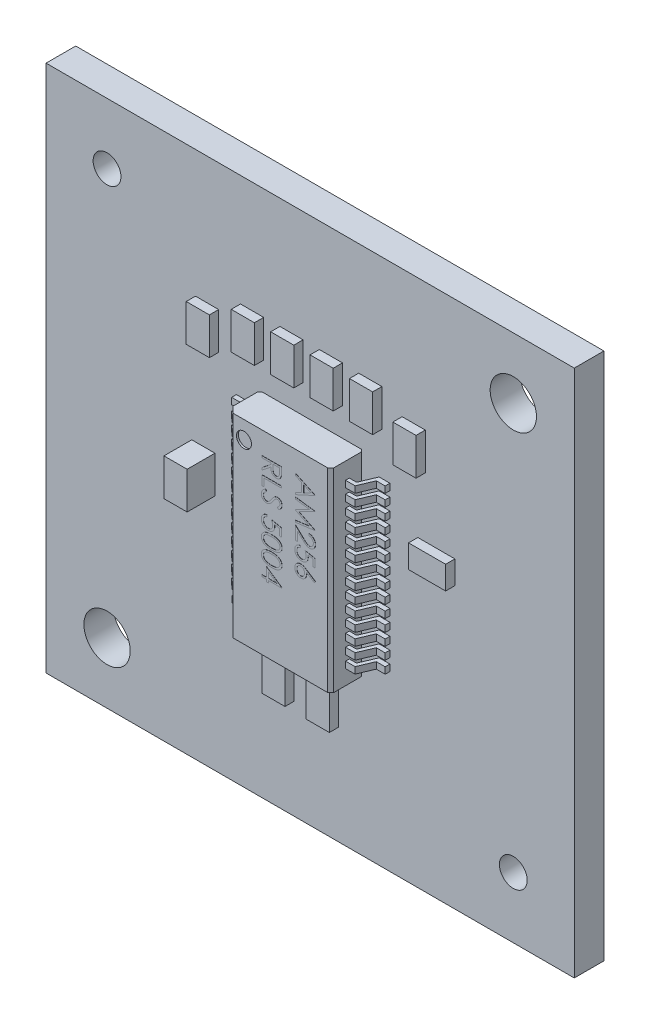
from build123d import *

# Parameters (mm, degrees)
SKETCH1_R           = 0.005
BASE_EXTRUDE_DEPTH  = 1.86
SKETCH5_R           = 0.404245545
CUT_EXTRUDE5_DEPTH  = 0.1
CUT_EXTRUDE9_DEPTH  = 11
BOSS_EXTRUDE1_DEPTH = 0.01
SKETCH7_W           = 28.5
SKETCH7_H           = 28.5
SKETCH7_R           = 1.25
SKETCH7_R_2         = 0.75
EXTRUDE1_DEPTH      = 1.6
SKETCH14_W          = 3.5
SKETCH14_H          = 1.6
SKETCH14_W_2        = 1.2
SKETCH14_H_2        = 1.2
BOSS_EXTRUDE2_DEPTH = 0.05
SKETCH12_W          = 1.25
SKETCH12_H          = 2
SKETCH12_W_2        = 2
SKETCH12_H_2        = 1.25
EXTRUDE6_DEPTH      = 0.5
SKETCH18_W          = 1.25
SKETCH18_H          = 2
BOSS_EXTRUDE4_DEPTH = 1


with BuildPart() as part:
    # Sketch1 → Base-Extrude (new body)
    with BuildSketch(Plane.XY):
        Polygon((7.968512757, 8.897793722), (9.301851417, 8.897793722), (9.301851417, 8.547793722), (7.968512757, 8.547793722), (7.968512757, 8.247793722), (9.301851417, 8.247793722), (9.301851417, 7.897793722), (7.968512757, 7.897793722), (7.968512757, 7.597793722), (9.301851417, 7.597793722), (9.301851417, 7.247793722), (7.968512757, 7.247793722), (7.968512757, 6.947793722), (9.301851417, 6.947793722), (9.301851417, 6.597793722), (7.968512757, 6.597793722), (7.968512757, 6.297793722), (9.301851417, 6.297793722), (9.301851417, 5.947793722), (7.968512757, 5.947793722), (7.968512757, 5.647793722), (9.301851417, 5.647793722), (9.301851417, 5.297793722), (7.968512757, 5.297793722), (7.968512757, 4.997793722), (9.301851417, 4.997793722), (9.301851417, 4.647793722), (7.968512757, 4.647793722), (7.968512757, 4.347793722), (9.301851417, 4.347793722), (9.301851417, 3.997793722), (7.968512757, 3.997793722), (7.968512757, 3.697793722), (9.301851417, 3.697793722), (9.301851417, 3.347793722), (7.968512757, 3.347793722), (7.968512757, 3.047793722), (9.301851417, 3.047793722), (9.301851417, 2.697793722), (7.968512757, 2.697793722), (7.968512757, 2.397793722), (9.301851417, 2.397793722), (9.301851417, 2.047793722), (7.968512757, 2.047793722), (7.968512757, 1.747793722), (9.301851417, 1.747793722), (9.301851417, 1.397793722), (7.968512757, 1.397793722), (7.968512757, 1.097793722), (9.301851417, 1.097793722), (9.301851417, 0.747793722), (7.968512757, 0.747793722), (7.968512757, 0.447793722), (9.301851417, 0.447793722), (9.301851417, 0.097793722), (7.968512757, 0.097793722), (7.968512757, -0.702206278), (2.368512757, -0.702206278), (2.368512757, 0.097793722), (1.018512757, 0.097793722), (1.018512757, 0.447793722), (2.368512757, 0.447793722), (2.368512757, 0.747793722), (1.018512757, 0.747793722), (1.018512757, 1.097793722), (2.368512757, 1.097793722), (2.368512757, 1.397793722), (1.018512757, 1.397793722), (1.018512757, 1.747793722), (2.368512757, 1.747793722), (2.368512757, 2.047793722), (1.018512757, 2.047793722), (1.018512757, 2.397793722), (2.368512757, 2.397793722), (2.368512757, 2.697793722), (1.018512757, 2.697793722), (1.018512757, 3.047793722), (2.368512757, 3.047793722), (2.368512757, 3.347793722), (1.018512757, 3.347793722), (1.018512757, 3.697793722), (2.368512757, 3.697793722), (2.368512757, 3.997793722), (1.018512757, 3.997793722), (1.018512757, 4.347793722), (2.368512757, 4.347793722), (2.368512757, 4.647793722), (1.018512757, 4.647793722), (1.018512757, 4.997793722), (2.368512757, 4.997793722), (2.368512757, 5.297793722), (1.018512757, 5.297793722), (1.018512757, 5.647793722), (2.368512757, 5.647793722), (2.368512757, 5.947793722), (1.018512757, 5.947793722), (1.018512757, 6.297793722), (2.368512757, 6.297793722), (2.368512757, 6.597793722), (1.018512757, 6.597793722), (1.018512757, 6.947793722), (2.368512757, 6.947793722), (2.368512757, 7.247793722), (1.018512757, 7.247793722), (1.018512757, 7.597793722), (2.368512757, 7.597793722), (2.368512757, 7.897793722), (1.018512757, 7.897793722), (1.018512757, 8.247793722), (2.368512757, 8.247793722), (2.368512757, 8.547793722), (1.018512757, 8.547793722), (1.018512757, 8.897793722), (2.368512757, 8.897793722), (2.368512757, 9.797793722), (7.968512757, 9.797793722), align=None)
        with Locations((5.168512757, 4.547793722)):
            Circle(SKETCH1_R, mode=Mode.SUBTRACT)
    extrude(amount=BASE_EXTRUDE_DEPTH)

    # Sketch5 → Cut-Extrude5 (cut)
    with BuildSketch(Plane.XY.offset(1.86)):
        with Locations((3.288537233, 8.84582504)):
            Circle(SKETCH5_R)
    extrude(amount=-CUT_EXTRUDE5_DEPTH, mode=Mode.SUBTRACT)

    # Sketch15 → Cut-Extrude9 (cut)
    with BuildSketch(Plane(origin=(0, 9.797793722, 0), x_dir=(1, 0, 0), z_dir=(0, 1, 0))):
        Polygon((1.018512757, -0.2554117), (1.515038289, -0.2554117), (1.85430492, -1.060183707), (2.368512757, -1.060183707), (2.368512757, -1.533579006), (2.706416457, -1.86), (2.651187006, -2.385690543), (0.552467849, -2.385690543), (0.552467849, -0.2554117), align=None)
        Polygon((1.617607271, 0), (1.978441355, -0.855932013), (2.368512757, -0.855932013), (2.368512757, -0.187465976), (2.485498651, -0.081833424), (7.851526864, -0.081833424), (7.968512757, -0.187465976), (7.968512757, -0.855932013), (8.35858416, -0.855932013), (8.719418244, 0), align=None)
        Polygon((9.784557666, -2.385690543), (7.747123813, -2.38958058), (7.802761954, -1.86), (7.968512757, -1.696789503), (7.968512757, -1.060183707), (8.482720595, -1.060183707), (8.821987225, -0.2554117), (9.784557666, -0.2554117), align=None)
    extrude(amount=-CUT_EXTRUDE9_DEPTH, mode=Mode.SUBTRACT)

    # Sketch6 → Boss-Extrude1 (add)
    # profile 1 of 12: a face of its own
    with BuildSketch(Plane.XY.offset(1.86)):
        Polygon((7.124163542, 8.168306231), (6.065830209, 7.679844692), (6.065830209, 7.783091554), (6.40503961, 7.939551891), (6.40503961, 8.419321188), (6.065830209, 8.580233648), (6.065830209, 8.683904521), (7.124163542, 8.181874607), align=None)
        Polygon((6.917881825, 8.176150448), (6.513586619, 8.36780376), (6.513586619, 7.989585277), align=None, mode=Mode.SUBTRACT)
    # profile 2 of 12: a face of its own
    with BuildSketch(Plane.XY.offset(1.86)):
        Polygon((6.065830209, 7.571297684), (7.124163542, 7.431585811), (7.124163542, 7.418017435), (6.255787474, 6.981073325), (7.124163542, 6.545189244), (7.124163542, 6.531408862), (6.065830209, 6.390848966), (6.065830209, 6.48625161), (6.827355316, 6.587590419), (6.065830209, 6.969625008), (6.065830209, 6.991037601), (6.829051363, 7.374556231), (6.065830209, 7.475683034), align=None)
    # profile 3 of 12: a face of its own
    with BuildSketch(Plane.XY.offset(1.86)):
        with BuildLine():
            Line((6.798522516, 6.133049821), (6.798522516, 6.228028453))
            add(Edge.make_bspline(
                [(6.798522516, 6.228028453), (6.811123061, 6.227409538), (6.835870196, 6.226194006), (6.871950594, 6.220499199), (6.906441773, 6.212358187), (6.939048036, 6.200820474), (6.970158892, 6.186572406), (6.999361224, 6.169128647), (7.026944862, 6.148861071), (7.052387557, 6.125806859), (7.075645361, 6.100790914), (7.095942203, 6.073963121), (7.112894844, 6.045599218), (7.12714393, 6.015945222), (7.137826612, 5.984658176), (7.145756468, 5.952037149), (7.150526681, 5.917934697), (7.151039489, 5.894699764), (7.151300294, 5.882882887)],
                knots=[0, 0, 0, 0, 1.100776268, 2.161895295, 3.184016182, 4.190939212, 5.176500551, 6.166955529, 7.155448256, 8.160289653, 9.16017456, 10.133824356, 11.091467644, 12.04088621, 13.000931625, 13.972173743, 14.968683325, 16, 16, 16, 16], degree=3))
            add(Edge.make_bspline(
                [(7.151300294, 5.882882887), (7.151028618, 5.871278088), (7.150494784, 5.848475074), (7.145910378, 5.815194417), (7.138730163, 5.783511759), (7.128656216, 5.753489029), (7.115114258, 5.725365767), (7.098846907, 5.698930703), (7.080032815, 5.673869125), (7.057882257, 5.651309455), (7.034235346, 5.630593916), (7.008990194, 5.61272252), (6.9829161, 5.597418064), (6.95581424, 5.584661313), (6.927429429, 5.575270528), (6.898174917, 5.568140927), (6.867747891, 5.564110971), (6.847153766, 5.563492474), (6.836683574, 5.563178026)],
                knots=[0, 0, 0, 0, 1.111607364, 2.184268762, 3.212621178, 4.221274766, 5.211760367, 6.196651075, 7.1921475, 8.207485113, 9.220403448, 10.201281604, 11.166441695, 12.114753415, 13.065576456, 14.026450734, 14.996634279, 16, 16, 16, 16], degree=3))
            add(Edge.make_bspline(
                [(6.836683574, 5.563178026), (6.821943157, 5.563690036), (6.792720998, 5.564705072), (6.749778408, 5.573387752), (6.708172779, 5.586948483), (6.674687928, 5.603276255), (6.647705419, 5.619747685), (6.625489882, 5.634590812), (6.601569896, 5.651967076), (6.576025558, 5.672129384), (6.548656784, 5.694660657), (6.519480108, 5.719764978), (6.488796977, 5.747621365), (6.467840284, 5.767172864), (6.45698105, 5.777303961)],
                knots=[0, 0, 0, 0, 1.184426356, 2.348067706, 3.509069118, 4.696110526, 5.333549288, 6.050745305, 6.844228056, 7.710549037, 8.667450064, 9.695053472, 10.805634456, 12, 12, 12, 12], degree=3))
            Line((6.45698105, 5.777303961), (6.174377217, 6.0420993))
            Line((6.174377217, 6.0420993), (6.174377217, 5.54960965))
            Line((6.174377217, 5.54960965), (6.065830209, 5.54960965))
            Line((6.065830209, 5.54960965), (6.065830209, 6.268733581))
            Line((6.065830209, 6.268733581), (6.503834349, 5.858290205))
            add(Edge.make_bspline(
                [(6.503834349, 5.858290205), (6.514265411, 5.848296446), (6.534301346, 5.82910048), (6.563562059, 5.801961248), (6.590675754, 5.777546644), (6.615762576, 5.755840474), (6.638680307, 5.736824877), (6.659608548, 5.720560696), (6.678367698, 5.706976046), (6.700405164, 5.692579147), (6.727343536, 5.678850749), (6.760098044, 5.666784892), (6.793890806, 5.659480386), (6.816720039, 5.658599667), (6.828203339, 5.658156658)],
                knots=[0, 0, 0, 0, 1.329530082, 2.553755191, 3.672934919, 4.687409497, 5.60679272, 6.413407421, 7.126401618, 7.737995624, 8.834647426, 9.90044882, 10.943907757, 12, 12, 12, 12], degree=3))
            add(Edge.make_bspline(
                [(6.828203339, 5.658156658), (6.835425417, 5.65834692), (6.849658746, 5.658721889), (6.870513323, 5.662093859), (6.890707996, 5.667047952), (6.90999307, 5.674683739), (6.928747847, 5.683857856), (6.946402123, 5.695578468), (6.963557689, 5.708972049), (6.979626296, 5.724507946), (6.994347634, 5.741563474), (7.007387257, 5.759584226), (7.018284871, 5.778649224), (7.027218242, 5.798679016), (7.034226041, 5.819617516), (7.039081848, 5.841505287), (7.0421306, 5.864281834), (7.042543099, 5.879834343), (7.042753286, 5.887759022)],
                knots=[0, 0, 0, 0, 0.991504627, 1.954065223, 2.895985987, 3.842598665, 4.797835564, 5.759220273, 6.74786863, 7.784730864, 8.824135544, 9.839918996, 10.835834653, 11.835434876, 12.84861661, 13.863796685, 14.911511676, 16, 16, 16, 16], degree=3))
            add(Edge.make_bspline(
                [(7.042753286, 5.887759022), (7.042537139, 5.896035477), (7.042112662, 5.912289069), (7.039141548, 5.93615216), (7.034020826, 5.958919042), (7.027000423, 5.980635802), (7.018161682, 6.001323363), (7.006940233, 6.020794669), (6.993774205, 6.039227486), (6.978765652, 6.05658796), (6.961976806, 6.072539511), (6.943492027, 6.086849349), (6.923191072, 6.099054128), (6.901532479, 6.109873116), (6.877940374, 6.118151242), (6.852986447, 6.125227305), (6.826316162, 6.130367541), (6.80794094, 6.132140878), (6.798522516, 6.133049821)],
                knots=[0, 0, 0, 0, 1.031212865, 2.025131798, 2.990757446, 3.934781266, 4.865570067, 5.788494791, 6.729227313, 7.684356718, 8.643577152, 9.610526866, 10.590658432, 11.59095419, 12.621640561, 13.700587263, 14.82141059, 16, 16, 16, 16], degree=3))
        make_face()
    # profile 4 of 12: a face of its own
    with BuildSketch(Plane.XY.offset(1.86)):
        with BuildLine():
            Line((7.124163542, 4.78978059), (7.015616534, 4.78978059))
            Line((7.015616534, 4.78978059), (7.015616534, 5.149766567))
            Line((7.015616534, 5.149766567), (6.737252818, 5.206796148))
            add(Edge.make_bspline(
                [(6.737252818, 5.206796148), (6.740346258, 5.195591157), (6.746339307, 5.17388326), (6.752993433, 5.141843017), (6.75700465, 5.11142585), (6.757552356, 5.091687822), (6.757817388, 5.082136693)],
                knots=[0, 0, 0, 0, 1.100273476, 2.13160584, 3.095893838, 4, 4, 4, 4], degree=3))
            add(Edge.make_bspline(
                [(6.757817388, 5.082136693), (6.757561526, 5.070318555), (6.757058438, 5.047081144), (6.752229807, 5.013081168), (6.74462452, 4.980627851), (6.734017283, 4.949776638), (6.720365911, 4.920461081), (6.703534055, 4.89284489), (6.683638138, 4.866771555), (6.660870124, 4.842585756), (6.635781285, 4.82067843), (6.608893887, 4.801340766), (6.580183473, 4.78525807), (6.549776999, 4.772026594), (6.517725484, 4.761528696), (6.483791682, 4.754522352), (6.448276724, 4.749862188), (6.423994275, 4.749341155), (6.411611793, 4.749075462)],
                knots=[0, 0, 0, 0, 1.052772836, 2.070014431, 3.053871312, 4.019926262, 4.972333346, 5.930471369, 6.896690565, 7.89035727, 8.885779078, 9.861050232, 10.836829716, 11.812751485, 12.812646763, 13.836748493, 14.896881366, 16, 16, 16, 16], degree=3))
            add(Edge.make_bspline(
                [(6.411611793, 4.749075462), (6.402987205, 4.749276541), (6.385854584, 4.749675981), (6.360411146, 4.751707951), (6.335505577, 4.755617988), (6.31113825, 4.760875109), (6.287341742, 4.767671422), (6.264124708, 4.775988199), (6.24141566, 4.785791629), (6.219213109, 4.796859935), (6.198201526, 4.809663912), (6.178056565, 4.823151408), (6.159519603, 4.838091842), (6.141913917, 4.853761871), (6.12593091, 4.870788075), (6.1108866, 4.888641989), (6.097434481, 4.907742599), (6.085061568, 4.927747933), (6.073983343, 4.948645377), (6.064742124, 4.970646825), (6.056642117, 4.993269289), (6.050055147, 5.0167144), (6.044944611, 5.040936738), (6.041464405, 5.066019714), (6.038932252, 5.091837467), (6.038773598, 5.109337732), (6.038693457, 5.118177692)],
                knots=[0, 0, 0, 0, 1.05623316, 2.098192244, 3.122504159, 4.140841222, 5.148757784, 6.150489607, 7.158294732, 8.176043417, 9.185147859, 10.169157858, 11.142149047, 12.097904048, 13.0527185, 13.998867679, 14.954465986, 15.910220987, 16.877849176, 17.847023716, 18.829548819, 19.818454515, 20.826519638, 21.858115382, 22.918063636, 24, 24, 24, 24], degree=3))
            add(Edge.make_bspline(
                [(6.038693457, 5.118177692), (6.038902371, 5.128722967), (6.039313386, 5.14946955), (6.043612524, 5.179865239), (6.049771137, 5.209109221), (6.059031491, 5.236970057), (6.070651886, 5.263682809), (6.085245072, 5.288891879), (6.102013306, 5.313092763), (6.12153515, 5.33562771), (6.143072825, 5.356500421), (6.166194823, 5.375471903), (6.190993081, 5.392109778), (6.217256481, 5.406481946), (6.245030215, 5.41872349), (6.274397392, 5.428344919), (6.305210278, 5.43610924), (6.326423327, 5.439394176), (6.33719773, 5.441062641)],
                knots=[0, 0, 0, 0, 1.046825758, 2.059506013, 3.044032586, 4.011925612, 4.970610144, 5.93275819, 6.900651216, 7.891265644, 8.889116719, 9.876966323, 10.858259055, 11.851035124, 12.847502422, 13.86866322, 14.9174643, 16, 16, 16, 16], degree=3))
            Line((6.33719773, 5.441062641), (6.33719773, 5.346084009))
            add(Edge.make_bspline(
                [(6.33719773, 5.346084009), (6.327104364, 5.343748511), (6.307704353, 5.339259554), (6.280463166, 5.329380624), (6.256096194, 5.317376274), (6.234580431, 5.302777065), (6.215719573, 5.285714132), (6.19876674, 5.266383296), (6.183675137, 5.244509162), (6.171014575, 5.220211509), (6.160232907, 5.194562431), (6.153049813, 5.167721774), (6.148000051, 5.140415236), (6.147494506, 5.121946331), (6.147240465, 5.112665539)],
                knots=[0, 0, 0, 0, 1.136389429, 2.184203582, 3.172920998, 4.111012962, 5.028380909, 5.957351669, 6.927793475, 7.937618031, 8.960409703, 9.974842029, 10.982339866, 12, 12, 12, 12], degree=3))
            add(Edge.make_bspline(
                [(6.147240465, 5.112665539), (6.147488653, 5.103606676), (6.147977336, 5.085769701), (6.151738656, 5.059519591), (6.157531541, 5.034176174), (6.166200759, 5.009989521), (6.176737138, 4.986536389), (6.190258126, 4.964410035), (6.205818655, 4.942970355), (6.223646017, 4.922883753), (6.243291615, 4.904487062), (6.264300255, 4.888232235), (6.286711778, 4.874692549), (6.310138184, 4.863282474), (6.334836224, 4.854618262), (6.36069015, 4.848437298), (6.387763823, 4.844807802), (6.406230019, 4.844308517), (6.415639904, 4.844054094)],
                knots=[0, 0, 0, 0, 1.027316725, 2.022795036, 3.002884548, 3.971462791, 4.93288096, 5.914575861, 6.907176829, 7.935150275, 8.956128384, 9.956726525, 10.942570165, 11.921478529, 12.907843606, 13.90538589, 14.932640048, 16, 16, 16, 16], degree=3))
            add(Edge.make_bspline(
                [(6.415639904, 4.844054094), (6.424134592, 4.844221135), (6.440771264, 4.844548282), (6.465003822, 4.848183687), (6.488098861, 4.853276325), (6.509849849, 4.86109542), (6.530575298, 4.870756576), (6.549831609, 4.883013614), (6.568113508, 4.89702467), (6.584678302, 4.913435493), (6.600070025, 4.931330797), (6.613171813, 4.951125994), (6.624199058, 4.97236957), (6.633714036, 4.994815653), (6.640548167, 5.018995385), (6.645678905, 5.044430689), (6.648646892, 5.071396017), (6.6490587, 5.089832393), (6.64927038, 5.099309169)],
                knots=[0, 0, 0, 0, 1.045726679, 2.048034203, 3.01323695, 3.95502507, 4.889743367, 5.8246644, 6.761650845, 7.722168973, 8.692072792, 9.66525385, 10.638902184, 11.638179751, 12.663148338, 13.728659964, 14.832472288, 16, 16, 16, 16], degree=3))
            add(Edge.make_bspline(
                [(6.64927038, 5.099309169), (6.649100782, 5.107583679), (6.648753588, 5.124522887), (6.646021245, 5.15056689), (6.641817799, 5.177816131), (6.635759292, 5.2063764), (6.628173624, 5.236169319), (6.618700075, 5.267244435), (6.607787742, 5.299602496), (6.599323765, 5.321381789), (6.594996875, 5.332515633)],
                knots=[0, 0, 0, 0, 0.824638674, 1.688163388, 2.607705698, 3.571998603, 4.597075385, 5.671199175, 6.809488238, 8, 8, 8, 8], degree=3))
            Line((6.594996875, 5.332515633), (7.124163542, 5.223968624))
            Line((7.124163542, 5.223968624), (7.124163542, 4.78978059))
        make_face()
    # profile 5 of 12: a face of its own
    with BuildSketch(Plane.XY.offset(1.86)):
        with BuildLine():
            Line((7.151300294, 4.152066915), (7.093846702, 4.078924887))
            Line((7.093846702, 4.078924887), (6.66623085, 4.358560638))
            add(Edge.make_bspline(
                [(6.66623085, 4.358560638), (6.669198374, 4.339942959), (6.674986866, 4.303627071), (6.675941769, 4.266867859), (6.676407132, 4.2489536)],
                knots=[0, 0, 0, 0, 1.025318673, 2, 2, 2, 2], degree=3))
            add(Edge.make_bspline(
                [(6.676407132, 4.2489536), (6.676118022, 4.238197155), (6.675548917, 4.217023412), (6.671169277, 4.185936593), (6.664267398, 4.156064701), (6.654206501, 4.127531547), (6.641354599, 4.100234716), (6.625951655, 4.074017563), (6.607202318, 4.049372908), (6.586257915, 4.025983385), (6.56306016, 4.004748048), (6.538445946, 3.985947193), (6.512440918, 3.970154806), (6.485058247, 3.957341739), (6.456340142, 3.947391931), (6.426323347, 3.940138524), (6.394987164, 3.935850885), (6.373675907, 3.935268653), (6.362850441, 3.934972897)],
                knots=[0, 0, 0, 0, 1.04369286, 2.054478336, 3.041073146, 4.015093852, 4.984733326, 5.965804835, 6.960378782, 7.985147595, 9.009457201, 10.008161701, 10.986880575, 11.956520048, 12.937015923, 13.931873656, 14.949455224, 16, 16, 16, 16], degree=3))
            add(Edge.make_bspline(
                [(6.362850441, 3.934972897), (6.348048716, 3.935525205), (6.318939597, 3.936611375), (6.276365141, 3.944518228), (6.236130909, 3.95816369), (6.198078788, 3.976419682), (6.163315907, 4.000105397), (6.131899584, 4.028174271), (6.104515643, 4.060891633), (6.081024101, 4.09748273), (6.062360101, 4.137085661), (6.048561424, 4.178610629), (6.040316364, 4.221702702), (6.039236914, 4.250968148), (6.038693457, 4.265702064)],
                knots=[0, 0, 0, 0, 1.031881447, 2.029301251, 3.006342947, 3.987068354, 4.962916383, 5.929513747, 6.915671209, 7.928552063, 8.953527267, 9.960179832, 10.973036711, 12, 12, 12, 12], degree=3))
            add(Edge.make_bspline(
                [(6.038693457, 4.265702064), (6.039155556, 4.279943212), (6.040070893, 4.308152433), (6.048224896, 4.349648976), (6.061441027, 4.389521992), (6.079648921, 4.427491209), (6.102646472, 4.462666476), (6.130336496, 4.494126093), (6.162107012, 4.521760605), (6.198055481, 4.544637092), (6.236435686, 4.563281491), (6.276819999, 4.576431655), (6.318395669, 4.584935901), (6.346696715, 4.5858133), (6.360942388, 4.586254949)],
                knots=[0, 0, 0, 0, 1.011913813, 2.004424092, 2.994488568, 3.992479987, 4.990471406, 5.973328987, 6.963763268, 7.974390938, 8.994854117, 9.989689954, 10.988086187, 12, 12, 12, 12], degree=3))
            add(Edge.make_bspline(
                [(6.360942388, 4.586254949), (6.371837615, 4.585871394), (6.394073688, 4.585088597), (6.427848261, 4.580416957), (6.462271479, 4.571848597), (6.49145295, 4.562575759), (6.515620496, 4.553374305), (6.534704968, 4.544842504), (6.554858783, 4.535302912), (6.575700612, 4.524121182), (6.59782595, 4.512267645), (6.620415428, 4.498421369), (6.644294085, 4.483972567), (6.660192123, 4.473387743), (6.668350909, 4.46795567)],
                knots=[0, 0, 0, 0, 1.17367173, 2.395347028, 3.66355231, 4.98980831, 5.690886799, 6.447442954, 7.240630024, 8.091733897, 8.994365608, 9.943299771, 10.944512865, 12, 12, 12, 12], degree=3))
            Line((6.668350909, 4.46795567), (7.151300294, 4.152066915))
        make_face()
        with BuildLine():
            add(Edge.make_bspline(
                [(6.567860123, 4.268882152), (6.567621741, 4.276944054), (6.567154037, 4.29276144), (6.564512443, 4.315938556), (6.559507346, 4.337814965), (6.553033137, 4.35864053), (6.544218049, 4.378198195), (6.533637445, 4.396711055), (6.521057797, 4.413995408), (6.506619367, 4.429747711), (6.491042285, 4.444212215), (6.474257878, 4.456654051), (6.456778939, 4.467398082), (6.438441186, 4.476130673), (6.419256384, 4.482931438), (6.399311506, 4.487850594), (6.378473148, 4.49058829), (6.364342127, 4.491043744), (6.357126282, 4.491276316)],
                knots=[0, 0, 0, 0, 1.129474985, 2.216020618, 3.260639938, 4.268601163, 5.26556745, 6.258792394, 7.250684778, 8.252748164, 9.247500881, 10.223461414, 11.174097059, 12.117127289, 13.062595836, 14.020469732, 14.98917545, 16, 16, 16, 16], degree=3))
            add(Edge.make_bspline(
                [(6.357126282, 4.491276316), (6.349975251, 4.491086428), (6.335953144, 4.490714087), (6.315284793, 4.487348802), (6.295413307, 4.482171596), (6.276324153, 4.474593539), (6.258121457, 4.46508844), (6.240675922, 4.453391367), (6.223975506, 4.43970038), (6.208441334, 4.42378488), (6.194193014, 4.406621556), (6.181506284, 4.388470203), (6.170852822, 4.369388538), (6.162430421, 4.349267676), (6.155532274, 4.328389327), (6.15067463, 4.306594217), (6.147929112, 4.283863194), (6.147473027, 4.268465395), (6.147240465, 4.260613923)],
                knots=[0, 0, 0, 0, 0.989642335, 1.94054129, 2.892446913, 3.828371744, 4.778262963, 5.730973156, 6.732161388, 7.763274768, 8.805796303, 9.818398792, 10.825975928, 11.825728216, 12.834635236, 13.867465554, 14.912602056, 16, 16, 16, 16], degree=3))
            add(Edge.make_bspline(
                [(6.147240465, 4.260613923), (6.147473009, 4.252762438), (6.147929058, 4.237364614), (6.150674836, 4.214633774), (6.155531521, 4.192837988), (6.162433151, 4.171962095), (6.170842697, 4.151832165), (6.18157304, 4.132733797), (6.194115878, 4.114409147), (6.208465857, 4.097257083), (6.223887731, 4.08127506), (6.240827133, 4.067904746), (6.257982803, 4.055838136), (6.276396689, 4.046698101), (6.295401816, 4.039035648), (6.315287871, 4.033884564), (6.335952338, 4.030512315), (6.349974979, 4.03014093), (6.357126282, 4.02995153)],
                knots=[0, 0, 0, 0, 1.087205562, 2.132157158, 3.164804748, 4.173533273, 5.173108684, 6.180507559, 7.20098426, 8.243321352, 9.274252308, 10.269075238, 11.227079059, 12.172305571, 13.108064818, 14.05980203, 15.010532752, 16, 16, 16, 16], degree=3))
            add(Edge.make_bspline(
                [(6.357126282, 4.02995153), (6.364352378, 4.030115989), (6.378534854, 4.030438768), (6.399292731, 4.034160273), (6.419418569, 4.039186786), (6.438458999, 4.047310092), (6.456940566, 4.056985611), (6.474335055, 4.069311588), (6.491135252, 4.083443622), (6.506722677, 4.099809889), (6.520980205, 4.117614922), (6.533564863, 4.136549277), (6.544186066, 4.156357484), (6.553047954, 4.177020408), (6.559443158, 4.198774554), (6.56447878, 4.221268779), (6.567158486, 4.244790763), (6.567623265, 4.260749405), (6.567860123, 4.268882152)],
                knots=[0, 0, 0, 0, 0.978265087, 1.920016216, 2.851775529, 3.783928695, 4.718195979, 5.674835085, 6.667117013, 7.690134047, 8.732874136, 9.755756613, 10.767227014, 11.776017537, 12.797239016, 13.836276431, 14.897336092, 16, 16, 16, 16], degree=3))
        make_face(mode=Mode.SUBTRACT)
    # profile 6 of 12: a face of its own
    with BuildSketch(Plane.XY.offset(1.86)):
        with BuildLine():
            Line((5.319569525, 8.602494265), (5.319569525, 8.390700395))
            add(Edge.make_bspline(
                [(5.319569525, 8.390700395), (5.319522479, 8.376566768), (5.319432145, 8.349428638), (5.31892845, 8.310550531), (5.317484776, 8.275224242), (5.316242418, 8.243468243), (5.313976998, 8.215283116), (5.311811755, 8.190582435), (5.308977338, 8.169479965), (5.306344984, 8.156705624), (5.305153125, 8.150921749)],
                knots=[0, 0, 0, 0, 1.410062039, 2.707475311, 3.878576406, 4.937260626, 5.877586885, 6.699081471, 7.410979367, 8, 8, 8, 8], degree=3))
            add(Edge.make_bspline(
                [(5.305153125, 8.150921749), (5.303240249, 8.143178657), (5.299455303, 8.127857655), (5.291451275, 8.105800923), (5.2822041, 8.084773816), (5.271258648, 8.064855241), (5.258805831, 8.046043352), (5.244772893, 8.028366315), (5.229088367, 8.011925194), (5.212152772, 7.996593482), (5.193818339, 7.98269578), (5.174352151, 7.970669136), (5.153875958, 7.960370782), (5.132318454, 7.952149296), (5.109861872, 7.945535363), (5.086310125, 7.940870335), (5.061768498, 7.93807307), (5.045029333, 7.937788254), (5.03654168, 7.937643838)],
                knots=[0, 0, 0, 0, 1.02737288, 2.032829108, 3.019628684, 3.985738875, 4.958353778, 5.924249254, 6.890702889, 7.883913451, 8.865824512, 9.85161466, 10.829249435, 11.81541824, 12.821369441, 13.843154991, 14.906364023, 16, 16, 16, 16], degree=3))
            add(Edge.make_bspline(
                [(5.03654168, 7.937643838), (5.022440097, 7.938088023), (4.994924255, 7.938954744), (4.954991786, 7.947036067), (4.917740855, 7.960272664), (4.883223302, 7.978515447), (4.852093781, 8.001736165), (4.824844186, 8.029642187), (4.801830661, 8.062091), (4.786041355, 8.092440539), (4.775881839, 8.11926245), (4.768697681, 8.141408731), (4.763240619, 8.165584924), (4.758280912, 8.191444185), (4.754496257, 8.219186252), (4.751808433, 8.248755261), (4.750080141, 8.280225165), (4.749827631, 8.30179695), (4.74969773, 8.312894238)],
                knots=[0, 0, 0, 0, 1.260402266, 2.459371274, 3.627181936, 4.786749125, 5.93865593, 7.087644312, 8.261344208, 9.485713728, 10.136162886, 10.825977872, 11.566646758, 12.35154167, 13.181268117, 14.0701832, 15.007234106, 16, 16, 16, 16], degree=3))
            Line((4.74969773, 8.312894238), (4.261236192, 7.924075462))
            Line((4.261236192, 7.924075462), (4.261236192, 8.041526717))
            Line((4.261236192, 8.041526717), (4.74969773, 8.430345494))
            Line((4.74969773, 8.430345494), (4.74969773, 8.507515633))
            Line((4.74969773, 8.507515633), (4.261236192, 8.507515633))
            Line((4.261236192, 8.507515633), (4.261236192, 8.602494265))
            Line((4.261236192, 8.602494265), (5.319569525, 8.602494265))
        make_face()
        with BuildLine():
            Line((5.211022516, 8.507515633), (4.858244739, 8.507515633))
            Line((4.858244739, 8.507515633), (4.856760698, 8.313742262))
            add(Edge.make_bspline(
                [(4.856760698, 8.313742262), (4.856756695, 8.304695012), (4.856748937, 8.287158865), (4.857956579, 8.261788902), (4.859330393, 8.23816687), (4.861431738, 8.216383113), (4.864139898, 8.196427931), (4.86752742, 8.178311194), (4.87147427, 8.162003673), (4.877582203, 8.142983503), (4.887264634, 8.121751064), (4.901327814, 8.098647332), (4.919130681, 8.079039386), (4.939164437, 8.062133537), (4.961644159, 8.049111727), (4.985572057, 8.039634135), (5.010741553, 8.033686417), (5.028029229, 8.032979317), (5.036753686, 8.03262247)],
                knots=[0, 0, 0, 0, 1.14660753, 2.222451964, 3.218720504, 4.145691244, 4.995719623, 5.770487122, 6.480909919, 7.121111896, 8.299844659, 9.430703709, 10.534634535, 11.641396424, 12.741395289, 13.810956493, 14.895269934, 16, 16, 16, 16], degree=3))
            add(Edge.make_bspline(
                [(5.036753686, 8.03262247), (5.045267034, 8.032980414), (5.062137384, 8.033689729), (5.086767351, 8.039645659), (5.110179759, 8.049263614), (5.131928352, 8.062750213), (5.151834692, 8.0790467), (5.168631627, 8.098401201), (5.18269808, 8.119839), (5.191621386, 8.139889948), (5.197103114, 8.157799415), (5.200955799, 8.173351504), (5.204077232, 8.190990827), (5.206504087, 8.210675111), (5.208687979, 8.232368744), (5.210103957, 8.256131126), (5.210959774, 8.281934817), (5.211001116, 8.299819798), (5.211022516, 8.309078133)],
                knots=[0, 0, 0, 0, 1.100801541, 2.181386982, 3.260112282, 4.364594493, 5.481957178, 6.577424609, 7.668452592, 8.790448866, 9.403819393, 10.091598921, 10.863153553, 11.720938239, 12.658472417, 13.685008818, 14.801622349, 16, 16, 16, 16], degree=3))
            Line((5.211022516, 8.309078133), (5.211022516, 8.507515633))
        make_face(mode=Mode.SUBTRACT)
    # profile 7 of 12: a face of its own
    with BuildSketch(Plane.XY.offset(1.86)):
        Polygon((5.319569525, 7.706981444), (5.319569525, 7.612002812), (4.3697832, 7.612002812), (4.3697832, 7.20495153), (4.261236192, 7.20495153), (4.261236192, 7.706981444), align=None)
    # profile 8 of 12: a face of its own
    with BuildSketch(Plane.XY.offset(1.86)):
        with BuildLine():
            Line((4.46539785, 7.13710965), (4.519035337, 7.04764317))
            add(Edge.make_bspline(
                [(4.519035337, 7.04764317), (4.505106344, 7.039322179), (4.478418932, 7.023379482), (4.442357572, 6.996784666), (4.411707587, 6.96922781), (4.386647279, 6.940504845), (4.366917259, 6.910791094), (4.352946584, 6.879892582), (4.344233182, 6.847913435), (4.343174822, 6.826149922), (4.342646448, 6.81528473)],
                knots=[0, 0, 0, 0, 1.272034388, 2.437168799, 3.508375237, 4.49857839, 5.41946034, 6.295179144, 7.148887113, 8, 8, 8, 8], degree=3))
            add(Edge.make_bspline(
                [(4.342646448, 6.81528473), (4.342904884, 6.806005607), (4.343417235, 6.787609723), (4.348340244, 6.760527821), (4.355903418, 6.734226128), (4.366735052, 6.709247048), (4.379839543, 6.685934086), (4.39566888, 6.665493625), (4.413387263, 6.647811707), (4.433168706, 6.633387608), (4.454369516, 6.622190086), (4.476325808, 6.614087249), (4.498941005, 6.608930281), (4.514273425, 6.608273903), (4.522003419, 6.607942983)],
                knots=[0, 0, 0, 0, 1.095270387, 2.171376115, 3.241375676, 4.322296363, 5.380636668, 6.392615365, 7.366724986, 8.328592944, 9.273498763, 10.190095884, 11.087518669, 12, 12, 12, 12], degree=3))
            add(Edge.make_bspline(
                [(4.522003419, 6.607942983), (4.530815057, 6.608388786), (4.548727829, 6.60929504), (4.57515582, 6.616954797), (4.601309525, 6.62900445), (4.617487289, 6.640120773), (4.625886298, 6.645892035)],
                knots=[0, 0, 0, 0, 0.938893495, 1.908633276, 2.914225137, 4, 4, 4, 4], degree=3))
            add(Edge.make_bspline(
                [(4.625886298, 6.645892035), (4.631960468, 6.650617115), (4.644749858, 6.660565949), (4.663468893, 6.677906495), (4.683249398, 6.697725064), (4.704011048, 6.720120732), (4.725374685, 6.745538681), (4.747785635, 6.773456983), (4.771176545, 6.804020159), (4.786644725, 6.825559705), (4.794642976, 6.836697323)],
                knots=[0, 0, 0, 0, 0.72226686, 1.520759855, 2.393439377, 3.351307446, 4.386958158, 5.510256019, 6.712608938, 8, 8, 8, 8], degree=3))
            add(Edge.make_bspline(
                [(4.794642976, 6.836697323), (4.802575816, 6.847830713), (4.817742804, 6.869116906), (4.840223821, 6.898908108), (4.860908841, 6.925512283), (4.879509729, 6.949064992), (4.896837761, 6.968956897), (4.911964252, 6.985915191), (4.925696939, 6.999314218), (4.93459842, 7.006770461), (4.938594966, 7.01011813)],
                knots=[0, 0, 0, 0, 1.452255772, 2.776602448, 3.96446981, 5.032613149, 5.964194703, 6.766668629, 7.446264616, 8, 8, 8, 8], degree=3))
            add(Edge.make_bspline(
                [(4.938594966, 7.01011813), (4.944824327, 7.014796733), (4.957075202, 7.023997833), (4.976223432, 7.036143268), (4.995824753, 7.046466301), (5.015931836, 7.05455872), (5.036262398, 7.061373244), (5.057081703, 7.065956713), (5.078296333, 7.068826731), (5.092572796, 7.069120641), (5.099719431, 7.069267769)],
                knots=[0, 0, 0, 0, 1.068054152, 2.10047183, 3.106115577, 4.101338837, 5.06977816, 6.043150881, 7.020423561, 8, 8, 8, 8], degree=3))
            add(Edge.make_bspline(
                [(5.099719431, 7.069267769), (5.110917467, 7.068874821), (5.133074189, 7.068097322), (5.165424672, 7.061468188), (5.196405, 7.051127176), (5.22533277, 7.036171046), (5.252140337, 7.017679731), (5.276418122, 6.995825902), (5.297001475, 6.96987929), (5.314776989, 6.941252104), (5.328811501, 6.910119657), (5.339454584, 6.877555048), (5.345404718, 6.843415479), (5.346268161, 6.820253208), (5.346706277, 6.808500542)],
                knots=[0, 0, 0, 0, 1.005541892, 1.989591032, 2.955705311, 3.932863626, 4.905387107, 5.876519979, 6.856563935, 7.871847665, 8.897921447, 9.918317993, 10.943742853, 12, 12, 12, 12], degree=3))
            add(Edge.make_bspline(
                [(5.346706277, 6.808500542), (5.346284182, 6.796027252), (5.345447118, 6.771291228), (5.337908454, 6.734837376), (5.325731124, 6.699672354), (5.311705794, 6.671366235), (5.297760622, 6.649250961), (5.285053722, 6.632386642), (5.270426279, 6.615296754), (5.253837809, 6.59784394), (5.235136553, 6.58032378), (5.214450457, 6.562476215), (5.191905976, 6.544259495), (5.175811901, 6.532540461), (5.167561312, 6.526532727)],
                knots=[0, 0, 0, 0, 1.286821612, 2.551921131, 3.825787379, 5.12137259, 5.803616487, 6.523126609, 7.299589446, 8.125436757, 9.008162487, 9.944516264, 10.946261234, 12, 12, 12, 12], degree=3))
            Line((5.167561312, 6.526532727), (5.102475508, 6.612395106))
            add(Edge.make_bspline(
                [(5.102475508, 6.612395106), (5.109154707, 6.61757971), (5.122017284, 6.627564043), (5.140030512, 6.642722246), (5.156485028, 6.657009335), (5.170777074, 6.671085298), (5.183689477, 6.684206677), (5.194744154, 6.696942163), (5.204051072, 6.709107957), (5.213978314, 6.724445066), (5.223881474, 6.743762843), (5.23208298, 6.767988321), (5.237188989, 6.793235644), (5.237832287, 6.81038433), (5.238159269, 6.819100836)],
                knots=[0, 0, 0, 0, 1.181667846, 2.275615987, 3.290305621, 4.226321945, 5.078535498, 5.862783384, 6.581873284, 7.217493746, 8.414623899, 9.604724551, 10.782505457, 12, 12, 12, 12], degree=3))
            add(Edge.make_bspline(
                [(5.238159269, 6.819100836), (5.237792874, 6.830033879), (5.237086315, 6.851117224), (5.229369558, 6.881049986), (5.217219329, 6.907990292), (5.200190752, 6.931138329), (5.180015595, 6.950411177), (5.156799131, 6.96435259), (5.131162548, 6.972743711), (5.113279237, 6.973767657), (5.104171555, 6.974289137)],
                knots=[0, 0, 0, 0, 1.14458467, 2.207223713, 3.21896685, 4.227309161, 5.202851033, 6.127160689, 7.046193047, 8, 8, 8, 8], degree=3))
            add(Edge.make_bspline(
                [(5.104171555, 6.974289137), (5.098502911, 6.974164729), (5.087156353, 6.973915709), (5.070348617, 6.970676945), (5.053690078, 6.966084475), (5.037106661, 6.959363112), (5.02020823, 6.950309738), (5.003040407, 6.937999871), (4.985169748, 6.922599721), (4.973558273, 6.910779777), (4.967427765, 6.904539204)],
                knots=[0, 0, 0, 0, 0.858526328, 1.718456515, 2.587092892, 3.476767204, 4.426280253, 5.487868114, 6.673670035, 8, 8, 8, 8], degree=3))
            add(Edge.make_bspline(
                [(4.967427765, 6.904539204), (4.965360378, 6.90222255), (4.960448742, 6.896718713), (4.952407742, 6.886656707), (4.942488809, 6.873369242), (4.930215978, 6.85720329), (4.91597944, 6.837860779), (4.899961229, 6.81533958), (4.88164134, 6.789890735), (4.868833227, 6.771831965), (4.862060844, 6.762283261)],
                knots=[0, 0, 0, 0, 0.420754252, 0.999615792, 1.744751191, 2.668019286, 3.750313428, 4.999500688, 6.413464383, 8, 8, 8, 8], degree=3))
            add(Edge.make_bspline(
                [(4.862060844, 6.762283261), (4.853702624, 6.750797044), (4.837518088, 6.728555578), (4.813201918, 6.696909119), (4.789420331, 6.668215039), (4.766325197, 6.642372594), (4.744091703, 6.619126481), (4.72245236, 6.598734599), (4.701562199, 6.580989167), (4.674779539, 6.561884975), (4.641886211, 6.54236392), (4.60158541, 6.525599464), (4.561127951, 6.515028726), (4.533935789, 6.513646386), (4.520519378, 6.51296435)],
                knots=[0, 0, 0, 0, 1.163667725, 2.253281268, 3.268753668, 4.215851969, 5.092017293, 5.902905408, 6.650798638, 7.335211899, 8.59617414, 9.77448103, 10.901945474, 12, 12, 12, 12], degree=3))
            add(Edge.make_bspline(
                [(4.520519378, 6.51296435), (4.511031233, 6.513163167), (4.492239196, 6.513556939), (4.464644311, 6.518079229), (4.43784807, 6.524713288), (4.412157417, 6.534680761), (4.38722859, 6.546941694), (4.363291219, 6.562085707), (4.340674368, 6.580341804), (4.318907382, 6.600632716), (4.299245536, 6.623182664), (4.281660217, 6.646959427), (4.266941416, 6.672117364), (4.255092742, 6.69853471), (4.24567891, 6.726065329), (4.238912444, 6.754738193), (4.23475006, 6.784633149), (4.234318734, 6.804953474), (4.234099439, 6.81528473)],
                knots=[0, 0, 0, 0, 0.983610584, 1.948120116, 2.894308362, 3.843560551, 4.801159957, 5.773581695, 6.77566113, 7.813174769, 8.857584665, 9.875476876, 10.877851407, 11.875574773, 12.875048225, 13.892438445, 14.928473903, 16, 16, 16, 16], degree=3))
            add(Edge.make_bspline(
                [(4.234099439, 6.81528473), (4.234255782, 6.823277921), (4.234566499, 6.839163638), (4.237248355, 6.862597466), (4.24118133, 6.885600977), (4.247177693, 6.907885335), (4.254624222, 6.929728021), (4.263741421, 6.950934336), (4.274594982, 6.971555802), (4.287202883, 6.991616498), (4.301733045, 7.011305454), (4.318524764, 7.030521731), (4.337462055, 7.049485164), (4.358739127, 7.067848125), (4.382128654, 7.08594909), (4.407826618, 7.10345144), (4.435699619, 7.120711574), (4.45531354, 7.131541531), (4.46539785, 7.13710965)],
                knots=[0, 0, 0, 0, 0.915384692, 1.819241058, 2.699029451, 3.586605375, 4.459625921, 5.340865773, 6.228072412, 7.126546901, 8.052715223, 9.028303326, 10.047266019, 11.120332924, 12.245748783, 13.433636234, 14.680528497, 16, 16, 16, 16], degree=3))
        make_face()
    # profile 9 of 12: a face of its own
    with BuildSketch(Plane.XY.offset(1.86)):
        with BuildLine():
            Line((5.319569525, 5.318947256), (5.211022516, 5.318947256))
            Line((5.211022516, 5.318947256), (5.211022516, 5.678933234))
            Line((5.211022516, 5.678933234), (4.932658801, 5.735962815))
            add(Edge.make_bspline(
                [(4.932658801, 5.735962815), (4.93575224, 5.724757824), (4.94174529, 5.703049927), (4.948399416, 5.671009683), (4.952410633, 5.640592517), (4.952958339, 5.620854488), (4.953223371, 5.61130336)],
                knots=[0, 0, 0, 0, 1.100273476, 2.13160584, 3.095893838, 4, 4, 4, 4], degree=3))
            add(Edge.make_bspline(
                [(4.953223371, 5.61130336), (4.952967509, 5.599485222), (4.952464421, 5.576247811), (4.947635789, 5.542247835), (4.940030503, 5.509794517), (4.929423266, 5.478943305), (4.915771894, 5.449627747), (4.898940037, 5.422011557), (4.879044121, 5.395938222), (4.856276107, 5.371752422), (4.831187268, 5.349845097), (4.80429987, 5.330507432), (4.775589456, 5.314424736), (4.745182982, 5.301193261), (4.713131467, 5.290695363), (4.679197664, 5.283689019), (4.643682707, 5.279028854), (4.619400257, 5.278507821), (4.607017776, 5.278242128)],
                knots=[0, 0, 0, 0, 1.052772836, 2.070014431, 3.053871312, 4.019926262, 4.972333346, 5.930471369, 6.896690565, 7.89035727, 8.885779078, 9.861050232, 10.836829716, 11.812751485, 12.812646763, 13.836748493, 14.896881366, 16, 16, 16, 16], degree=3))
            add(Edge.make_bspline(
                [(4.607017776, 5.278242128), (4.598393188, 5.278443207), (4.581260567, 5.278842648), (4.555817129, 5.280874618), (4.53091156, 5.284784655), (4.506544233, 5.290041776), (4.482747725, 5.296838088), (4.459530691, 5.305154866), (4.436821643, 5.314958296), (4.414619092, 5.326026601), (4.393607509, 5.338830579), (4.373462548, 5.352318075), (4.354925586, 5.367258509), (4.337319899, 5.382928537), (4.321336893, 5.399954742), (4.306292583, 5.417808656), (4.292840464, 5.436909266), (4.280467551, 5.4569146), (4.269389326, 5.477812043), (4.260148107, 5.499813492), (4.252048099, 5.522435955), (4.24546113, 5.545881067), (4.240350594, 5.570103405), (4.236870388, 5.595186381), (4.234338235, 5.621004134), (4.234179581, 5.638504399), (4.234099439, 5.647344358)],
                knots=[0, 0, 0, 0, 1.05623316, 2.098192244, 3.122504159, 4.140841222, 5.148757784, 6.150489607, 7.158294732, 8.176043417, 9.185147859, 10.169157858, 11.142149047, 12.097904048, 13.0527185, 13.998867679, 14.954465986, 15.910220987, 16.877849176, 17.847023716, 18.829548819, 19.818454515, 20.826519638, 21.858115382, 22.918063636, 24, 24, 24, 24], degree=3))
            add(Edge.make_bspline(
                [(4.234099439, 5.647344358), (4.234308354, 5.657889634), (4.234719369, 5.678636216), (4.239018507, 5.709031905), (4.24517712, 5.738275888), (4.254437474, 5.766136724), (4.266057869, 5.792849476), (4.280651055, 5.818058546), (4.297419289, 5.84225943), (4.316941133, 5.864794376), (4.338478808, 5.885667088), (4.361600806, 5.904638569), (4.386399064, 5.921276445), (4.412662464, 5.935648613), (4.440436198, 5.947890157), (4.469803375, 5.957511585), (4.500616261, 5.965275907), (4.521829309, 5.968560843), (4.532603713, 5.970229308)],
                knots=[0, 0, 0, 0, 1.046825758, 2.059506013, 3.044032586, 4.011925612, 4.970610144, 5.93275819, 6.900651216, 7.891265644, 8.889116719, 9.876966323, 10.858259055, 11.851035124, 12.847502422, 13.86866322, 14.9174643, 16, 16, 16, 16], degree=3))
            Line((4.532603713, 5.970229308), (4.532603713, 5.875250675))
            add(Edge.make_bspline(
                [(4.532603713, 5.875250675), (4.522510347, 5.872915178), (4.503110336, 5.868426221), (4.475869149, 5.858547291), (4.451502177, 5.84654294), (4.429986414, 5.831943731), (4.411125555, 5.814880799), (4.394172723, 5.795549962), (4.37908112, 5.773675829), (4.366420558, 5.749378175), (4.355638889, 5.723729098), (4.348455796, 5.696888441), (4.343406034, 5.669581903), (4.342900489, 5.651112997), (4.342646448, 5.641832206)],
                knots=[0, 0, 0, 0, 1.136389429, 2.184203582, 3.172920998, 4.111012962, 5.028380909, 5.957351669, 6.927793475, 7.937618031, 8.960409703, 9.974842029, 10.982339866, 12, 12, 12, 12], degree=3))
            add(Edge.make_bspline(
                [(4.342646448, 5.641832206), (4.342894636, 5.632773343), (4.343383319, 5.614936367), (4.347144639, 5.588686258), (4.352937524, 5.563342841), (4.361606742, 5.539156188), (4.372143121, 5.515703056), (4.385664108, 5.493576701), (4.401224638, 5.472137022), (4.419052, 5.452050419), (4.438697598, 5.433653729), (4.459706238, 5.417398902), (4.482117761, 5.403859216), (4.505544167, 5.39244914), (4.530242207, 5.383784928), (4.556096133, 5.377603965), (4.583169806, 5.373974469), (4.601636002, 5.373475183), (4.611045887, 5.373220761)],
                knots=[0, 0, 0, 0, 1.027316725, 2.022795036, 3.002884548, 3.971462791, 4.93288096, 5.914575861, 6.907176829, 7.935150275, 8.956128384, 9.956726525, 10.942570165, 11.921478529, 12.907843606, 13.90538589, 14.932640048, 16, 16, 16, 16], degree=3))
            add(Edge.make_bspline(
                [(4.611045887, 5.373220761), (4.619540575, 5.373387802), (4.636177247, 5.373714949), (4.660409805, 5.377350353), (4.683504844, 5.382442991), (4.705255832, 5.390262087), (4.725981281, 5.399923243), (4.745237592, 5.412180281), (4.763519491, 5.426191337), (4.780084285, 5.44260216), (4.795476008, 5.460497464), (4.808577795, 5.480292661), (4.819605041, 5.501536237), (4.829120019, 5.52398232), (4.83595415, 5.548162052), (4.841084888, 5.573597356), (4.844052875, 5.600562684), (4.844464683, 5.61899906), (4.844676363, 5.628475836)],
                knots=[0, 0, 0, 0, 1.045726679, 2.048034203, 3.01323695, 3.95502507, 4.889743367, 5.8246644, 6.761650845, 7.722168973, 8.692072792, 9.66525385, 10.638902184, 11.638179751, 12.663148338, 13.728659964, 14.832472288, 16, 16, 16, 16], degree=3))
            add(Edge.make_bspline(
                [(4.844676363, 5.628475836), (4.844506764, 5.636750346), (4.844159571, 5.653689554), (4.841427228, 5.679733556), (4.837223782, 5.706982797), (4.831165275, 5.735543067), (4.823579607, 5.765335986), (4.814106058, 5.796411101), (4.803193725, 5.828769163), (4.794729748, 5.850548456), (4.790402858, 5.861682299)],
                knots=[0, 0, 0, 0, 0.824638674, 1.688163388, 2.607705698, 3.571998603, 4.597075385, 5.671199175, 6.809488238, 8, 8, 8, 8], degree=3))
            Line((4.790402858, 5.861682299), (5.319569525, 5.753135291))
            Line((5.319569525, 5.753135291), (5.319569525, 5.318947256))
        make_face()
    # profile 10 of 12: a face of its own
    with BuildSketch(Plane.XY.offset(1.86)):
        with BuildLine():
            add(Edge.make_bspline(
                [(4.789978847, 5.16969512), (4.806941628, 5.169595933), (4.839892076, 5.169403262), (4.887905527, 5.167259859), (4.932948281, 5.16369922), (4.975022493, 5.158819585), (5.014139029, 5.152881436), (5.050193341, 5.144954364), (5.083352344, 5.135939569), (5.113724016, 5.125491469), (5.14171806, 5.113702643), (5.167850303, 5.100870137), (5.192087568, 5.086491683), (5.214793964, 5.071364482), (5.235716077, 5.054935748), (5.254814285, 5.037378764), (5.27210012, 5.018519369), (5.287779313, 4.998730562), (5.301437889, 4.977887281), (5.313745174, 4.956632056), (5.323846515, 4.934589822), (5.332146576, 4.911961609), (5.338797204, 4.888813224), (5.343402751, 4.865049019), (5.346289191, 4.840663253), (5.346565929, 4.824204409), (5.346706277, 4.815857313)],
                knots=[0, 0, 0, 0, 1.646377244, 3.198111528, 4.663803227, 6.031090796, 7.308794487, 8.502186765, 9.612154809, 10.642545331, 11.617106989, 12.558866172, 13.465886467, 14.35053239, 15.20542558, 16.045215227, 16.865619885, 17.686225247, 18.492864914, 19.282407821, 20.068097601, 20.842842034, 21.620163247, 22.403093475, 23.190129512, 24, 24, 24, 24], degree=3))
            add(Edge.make_bspline(
                [(5.346706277, 4.815857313), (5.346558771, 4.807440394), (5.346265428, 4.790701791), (5.343446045, 4.765954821), (5.338767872, 4.74177956), (5.332139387, 4.718279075), (5.323915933, 4.695260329), (5.313608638, 4.672903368), (5.301610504, 4.651069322), (5.287512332, 4.630105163), (5.271793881, 4.609780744), (5.25402517, 4.590595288), (5.234385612, 4.572547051), (5.213085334, 4.555409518), (5.189715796, 4.539668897), (5.164683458, 4.524678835), (5.137550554, 4.511261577), (5.108769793, 4.498339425), (5.07754483, 4.487185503), (5.044051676, 4.477126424), (5.00789472, 4.468998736), (4.969263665, 4.462228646), (4.92801664, 4.45698388), (4.884242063, 4.45316401), (4.837911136, 4.451146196), (4.806234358, 4.450766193), (4.789978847, 4.450571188)],
                knots=[0, 0, 0, 0, 0.810914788, 1.612654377, 2.396697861, 3.181598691, 3.963628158, 4.749916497, 5.551656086, 6.361998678, 7.18212741, 8.025565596, 8.878627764, 9.750805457, 10.657531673, 11.591944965, 12.560506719, 13.57287815, 14.630710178, 15.753379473, 16.941251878, 18.199788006, 19.531962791, 20.947069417, 22.433333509, 24, 24, 24, 24], degree=3))
            add(Edge.make_bspline(
                [(4.789978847, 4.450571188), (4.773794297, 4.450768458), (4.742259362, 4.451152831), (4.696136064, 4.453138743), (4.652596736, 4.457069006), (4.61152018, 4.461930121), (4.573150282, 4.468854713), (4.537122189, 4.476726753), (4.503746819, 4.486510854), (4.472686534, 4.497512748), (4.44404678, 4.510154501), (4.417148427, 4.523690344), (4.392136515, 4.538588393), (4.368767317, 4.554422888), (4.34728231, 4.571414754), (4.327628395, 4.589539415), (4.309818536, 4.608810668), (4.293885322, 4.629181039), (4.279951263, 4.650474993), (4.267496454, 4.67223616), (4.25739015, 4.694898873), (4.248857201, 4.717959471), (4.242213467, 4.741635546), (4.237664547, 4.765903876), (4.234465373, 4.790684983), (4.23422184, 4.807437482), (4.234099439, 4.815857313)],
                knots=[0, 0, 0, 0, 1.56130642, 3.042141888, 4.451772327, 5.777565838, 7.030558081, 8.211376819, 9.333164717, 10.383253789, 11.387583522, 12.350962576, 13.286244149, 14.193812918, 15.072134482, 15.925989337, 16.770211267, 17.600669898, 18.417446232, 19.22325363, 20.01647746, 20.807971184, 21.593601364, 22.38506573, 23.188331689, 24, 24, 24, 24], degree=3))
            add(Edge.make_bspline(
                [(4.234099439, 4.815857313), (4.234241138, 4.82420407), (4.234520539, 4.840662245), (4.237387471, 4.865052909), (4.242062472, 4.888780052), (4.2484111, 4.911891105), (4.25647983, 4.934433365), (4.266742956, 4.95618601), (4.278646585, 4.977436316), (4.292189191, 4.998087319), (4.307708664, 5.017745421), (4.324872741, 5.036523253), (4.34411193, 5.053946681), (4.365118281, 5.070169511), (4.387713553, 5.085564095), (4.412120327, 5.099801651), (4.438497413, 5.112609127), (4.466645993, 5.124662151), (4.497240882, 5.135286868), (4.530576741, 5.144601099), (4.566837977, 5.152365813), (4.605916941, 5.158610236), (4.647842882, 5.163758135), (4.692689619, 5.167242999), (4.740418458, 5.169404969), (4.773157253, 5.169596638), (4.789978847, 5.16969512)],
                knots=[0, 0, 0, 0, 0.810940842, 1.599017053, 2.38298203, 3.159479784, 3.926441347, 4.70693857, 5.494146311, 6.292334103, 7.104379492, 7.925868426, 8.762126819, 9.623561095, 10.503686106, 11.41783325, 12.366995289, 13.351843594, 14.392337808, 15.512229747, 16.713911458, 17.994391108, 19.357476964, 20.818259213, 22.365182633, 24, 24, 24, 24], degree=3))
        make_face()
        with BuildLine():
            add(Edge.make_bspline(
                [(4.790402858, 5.074716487), (4.776266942, 5.074680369), (4.748831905, 5.07461027), (4.708965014, 5.07277899), (4.671781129, 5.070284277), (4.637233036, 5.067066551), (4.605437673, 5.062288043), (4.576176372, 5.056933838), (4.549603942, 5.050418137), (4.525538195, 5.042708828), (4.503570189, 5.033928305), (4.483129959, 5.024339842), (4.463969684, 5.014044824), (4.44628397, 5.002503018), (4.429896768, 4.989976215), (4.414855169, 4.976443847), (4.401224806, 4.961929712), (4.385051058, 4.941837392), (4.368139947, 4.915442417), (4.3535951, 4.88201516), (4.344395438, 4.847652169), (4.343228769, 4.824322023), (4.342646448, 4.812677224)],
                knots=[0, 0, 0, 0, 1.459116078, 2.831857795, 4.118796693, 5.306371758, 6.412361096, 7.436813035, 8.376339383, 9.234574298, 10.043323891, 10.816788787, 11.564361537, 12.286735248, 12.994408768, 13.691741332, 14.372975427, 15.047457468, 16.352811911, 17.594285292, 18.799233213, 20, 20, 20, 20], degree=3))
            add(Edge.make_bspline(
                [(4.342646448, 4.812677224), (4.343129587, 4.800957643), (4.344094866, 4.777542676), (4.353407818, 4.743333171), (4.367459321, 4.71012259), (4.3840744, 4.684096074), (4.39989749, 4.6642954), (4.41338811, 4.650108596), (4.428493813, 4.637087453), (4.444791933, 4.624737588), (4.462593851, 4.613410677), (4.481813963, 4.603110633), (4.502505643, 4.59371162), (4.516950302, 4.588356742), (4.524335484, 4.585618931)],
                knots=[0, 0, 0, 0, 1.353760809, 2.704726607, 4.075137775, 5.516104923, 6.260822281, 7.007110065, 7.778089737, 8.566572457, 9.372053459, 10.217411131, 11.088608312, 12, 12, 12, 12], degree=3))
            add(Edge.make_bspline(
                [(4.524335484, 4.585618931), (4.533778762, 4.582428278), (4.552952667, 4.575949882), (4.582695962, 4.567600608), (4.613902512, 4.561025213), (4.646385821, 4.555109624), (4.680385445, 4.551071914), (4.715796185, 4.54782198), (4.75264474, 4.545907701), (4.777680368, 4.545670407), (4.790402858, 4.545549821)],
                knots=[0, 0, 0, 0, 0.884706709, 1.796334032, 2.740027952, 3.714592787, 4.726048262, 5.777819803, 6.87074269, 8, 8, 8, 8], degree=3))
            add(Edge.make_bspline(
                [(4.790402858, 4.545549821), (4.803125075, 4.545682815), (4.82801553, 4.545943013), (4.864430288, 4.547652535), (4.899076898, 4.550399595), (4.931986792, 4.554117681), (4.963101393, 4.559221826), (4.992465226, 4.565351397), (5.020070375, 4.572537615), (5.045988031, 4.580780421), (5.070125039, 4.59006995), (5.09253395, 4.600332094), (5.113333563, 4.611283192), (5.132464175, 4.623179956), (5.150012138, 4.635878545), (5.165625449, 4.649714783), (5.179788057, 4.66413967), (5.19595412, 4.684343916), (5.212437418, 4.710794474), (5.227606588, 4.743707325), (5.236317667, 4.77795821), (5.237545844, 4.801112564), (5.238159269, 4.812677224)],
                knots=[0, 0, 0, 0, 1.313668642, 2.570134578, 3.763346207, 4.902004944, 5.98888779, 7.017888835, 7.998425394, 8.933058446, 9.82474457, 10.667209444, 11.476765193, 12.250262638, 12.991704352, 13.7104269, 14.401925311, 15.076585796, 16.378385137, 17.609787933, 18.806186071, 20, 20, 20, 20], degree=3))
            add(Edge.make_bspline(
                [(5.238159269, 4.812677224), (5.237545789, 4.824383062), (5.236317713, 4.847816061), (5.227629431, 4.882415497), (5.212578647, 4.915562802), (5.195847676, 4.94180115), (5.180074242, 4.961979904), (5.166357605, 4.976228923), (5.151270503, 4.989550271), (5.13495268, 5.00208751), (5.117258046, 5.013618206), (5.098100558, 5.023917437), (5.077658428, 5.033500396), (5.05569542, 5.04229977), (5.031593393, 5.049937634), (5.00515507, 5.056764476), (4.975866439, 5.062115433), (4.943982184, 5.066784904), (4.909391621, 5.070345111), (4.872122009, 5.072772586), (4.832186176, 5.074613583), (4.804609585, 5.074681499), (4.790402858, 5.074716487)],
                knots=[0, 0, 0, 0, 1.207964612, 2.418129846, 3.655795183, 4.951004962, 5.620895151, 6.296795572, 6.989224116, 7.696855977, 8.419187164, 9.166715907, 9.940135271, 10.748837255, 11.607021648, 12.548275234, 13.5654991, 14.678641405, 15.874140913, 17.15372626, 18.533675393, 20, 20, 20, 20], degree=3))
        make_face(mode=Mode.SUBTRACT)
    # profile 11 of 12: a face of its own
    with BuildSketch(Plane.XY.offset(1.86)):
        with BuildLine():
            add(Edge.make_bspline(
                [(4.789978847, 4.355592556), (4.806941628, 4.355493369), (4.839892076, 4.355300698), (4.887905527, 4.353157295), (4.932948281, 4.349596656), (4.975022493, 4.344717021), (5.014139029, 4.338778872), (5.050193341, 4.3308518), (5.083352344, 4.321837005), (5.113724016, 4.311388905), (5.14171806, 4.299600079), (5.167850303, 4.286767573), (5.192087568, 4.272389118), (5.214793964, 4.257261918), (5.235716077, 4.240833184), (5.254814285, 4.223276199), (5.27210012, 4.204416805), (5.287779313, 4.184627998), (5.301437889, 4.163784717), (5.313745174, 4.142529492), (5.323846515, 4.120487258), (5.332146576, 4.097859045), (5.338797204, 4.07471066), (5.343402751, 4.050946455), (5.346289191, 4.026560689), (5.346565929, 4.010101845), (5.346706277, 4.001754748)],
                knots=[0, 0, 0, 0, 1.646377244, 3.198111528, 4.663803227, 6.031090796, 7.308794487, 8.502186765, 9.612154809, 10.642545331, 11.617106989, 12.558866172, 13.465886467, 14.35053239, 15.20542558, 16.045215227, 16.865619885, 17.686225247, 18.492864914, 19.282407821, 20.068097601, 20.842842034, 21.620163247, 22.403093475, 23.190129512, 24, 24, 24, 24], degree=3))
            add(Edge.make_bspline(
                [(5.346706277, 4.001754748), (5.346558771, 3.99333783), (5.346265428, 3.976599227), (5.343446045, 3.951852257), (5.338767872, 3.927676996), (5.332139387, 3.904176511), (5.323915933, 3.881157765), (5.313608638, 3.858800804), (5.301610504, 3.836966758), (5.287512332, 3.816002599), (5.271793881, 3.79567818), (5.25402517, 3.776492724), (5.234385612, 3.758444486), (5.213085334, 3.741306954), (5.189715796, 3.725566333), (5.164683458, 3.710576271), (5.137550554, 3.697159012), (5.108769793, 3.684236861), (5.07754483, 3.673082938), (5.044051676, 3.66302386), (5.00789472, 3.654896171), (4.969263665, 3.648126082), (4.92801664, 3.642881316), (4.884242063, 3.639061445), (4.837911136, 3.637043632), (4.806234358, 3.636663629), (4.789978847, 3.636468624)],
                knots=[0, 0, 0, 0, 0.810914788, 1.612654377, 2.396697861, 3.181598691, 3.963628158, 4.749916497, 5.551656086, 6.361998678, 7.18212741, 8.025565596, 8.878627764, 9.750805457, 10.657531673, 11.591944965, 12.560506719, 13.57287815, 14.630710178, 15.753379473, 16.941251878, 18.199788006, 19.531962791, 20.947069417, 22.433333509, 24, 24, 24, 24], degree=3))
            add(Edge.make_bspline(
                [(4.789978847, 3.636468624), (4.773794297, 3.636665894), (4.742259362, 3.637050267), (4.696136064, 3.639036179), (4.652596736, 3.642966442), (4.61152018, 3.647827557), (4.573150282, 3.654752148), (4.537122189, 3.662624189), (4.503746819, 3.67240829), (4.472686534, 3.683410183), (4.44404678, 3.696051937), (4.417148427, 3.70958778), (4.392136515, 3.724485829), (4.368767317, 3.740320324), (4.34728231, 3.75731219), (4.327628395, 3.775436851), (4.309818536, 3.794708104), (4.293885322, 3.815078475), (4.279951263, 3.836372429), (4.267496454, 3.858133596), (4.25739015, 3.880796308), (4.248857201, 3.903856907), (4.242213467, 3.927532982), (4.237664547, 3.951801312), (4.234465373, 3.976582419), (4.23422184, 3.993334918), (4.234099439, 4.001754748)],
                knots=[0, 0, 0, 0, 1.56130642, 3.042141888, 4.451772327, 5.777565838, 7.030558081, 8.211376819, 9.333164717, 10.383253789, 11.387583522, 12.350962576, 13.286244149, 14.193812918, 15.072134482, 15.925989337, 16.770211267, 17.600669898, 18.417446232, 19.22325363, 20.01647746, 20.807971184, 21.593601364, 22.38506573, 23.188331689, 24, 24, 24, 24], degree=3))
            add(Edge.make_bspline(
                [(4.234099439, 4.001754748), (4.234241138, 4.010101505), (4.234520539, 4.026559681), (4.237387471, 4.050950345), (4.242062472, 4.074677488), (4.2484111, 4.09778854), (4.25647983, 4.120330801), (4.266742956, 4.142083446), (4.278646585, 4.163333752), (4.292189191, 4.183984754), (4.307708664, 4.203642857), (4.324872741, 4.222420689), (4.34411193, 4.239844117), (4.365118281, 4.256066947), (4.387713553, 4.271461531), (4.412120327, 4.285699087), (4.438497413, 4.298506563), (4.466645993, 4.310559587), (4.497240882, 4.321184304), (4.530576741, 4.330498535), (4.566837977, 4.338263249), (4.605916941, 4.344507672), (4.647842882, 4.349655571), (4.692689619, 4.353140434), (4.740418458, 4.355302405), (4.773157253, 4.355494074), (4.789978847, 4.355592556)],
                knots=[0, 0, 0, 0, 0.810940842, 1.599017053, 2.38298203, 3.159479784, 3.926441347, 4.70693857, 5.494146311, 6.292334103, 7.104379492, 7.925868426, 8.762126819, 9.623561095, 10.503686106, 11.41783325, 12.366995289, 13.351843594, 14.392337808, 15.512229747, 16.713911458, 17.994391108, 19.357476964, 20.818259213, 22.365182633, 24, 24, 24, 24], degree=3))
        make_face()
        with BuildLine():
            add(Edge.make_bspline(
                [(4.790402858, 4.260613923), (4.776266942, 4.260577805), (4.748831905, 4.260507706), (4.708965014, 4.258676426), (4.671781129, 4.256181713), (4.637233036, 4.252963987), (4.605437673, 4.248185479), (4.576176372, 4.242831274), (4.549603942, 4.236315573), (4.525538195, 4.228606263), (4.503570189, 4.219825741), (4.483129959, 4.210237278), (4.463969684, 4.19994226), (4.44628397, 4.188400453), (4.429896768, 4.175873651), (4.414855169, 4.162341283), (4.401224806, 4.147827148), (4.385051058, 4.127734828), (4.368139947, 4.101339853), (4.3535951, 4.067912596), (4.344395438, 4.033549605), (4.343228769, 4.010219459), (4.342646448, 3.99857466)],
                knots=[0, 0, 0, 0, 1.459116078, 2.831857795, 4.118796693, 5.306371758, 6.412361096, 7.436813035, 8.376339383, 9.234574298, 10.043323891, 10.816788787, 11.564361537, 12.286735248, 12.994408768, 13.691741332, 14.372975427, 15.047457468, 16.352811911, 17.594285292, 18.799233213, 20, 20, 20, 20], degree=3))
            add(Edge.make_bspline(
                [(4.342646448, 3.99857466), (4.343129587, 3.986855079), (4.344094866, 3.963440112), (4.353407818, 3.929230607), (4.367459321, 3.896020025), (4.3840744, 3.86999351), (4.39989749, 3.850192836), (4.41338811, 3.836006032), (4.428493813, 3.822984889), (4.444791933, 3.810635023), (4.462593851, 3.799308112), (4.481813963, 3.789008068), (4.502505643, 3.779609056), (4.516950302, 3.774254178), (4.524335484, 3.771516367)],
                knots=[0, 0, 0, 0, 1.353760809, 2.704726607, 4.075137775, 5.516104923, 6.260822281, 7.007110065, 7.778089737, 8.566572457, 9.372053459, 10.217411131, 11.088608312, 12, 12, 12, 12], degree=3))
            add(Edge.make_bspline(
                [(4.524335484, 3.771516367), (4.533778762, 3.768325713), (4.552952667, 3.761847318), (4.582695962, 3.753498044), (4.613902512, 3.746922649), (4.646385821, 3.74100706), (4.680385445, 3.73696935), (4.715796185, 3.733719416), (4.75264474, 3.731805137), (4.777680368, 3.731567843), (4.790402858, 3.731447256)],
                knots=[0, 0, 0, 0, 0.884706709, 1.796334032, 2.740027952, 3.714592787, 4.726048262, 5.777819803, 6.87074269, 8, 8, 8, 8], degree=3))
            add(Edge.make_bspline(
                [(4.790402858, 3.731447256), (4.803125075, 3.731580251), (4.82801553, 3.731840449), (4.864430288, 3.733549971), (4.899076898, 3.736297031), (4.931986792, 3.740015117), (4.963101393, 3.745119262), (4.992465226, 3.751248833), (5.020070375, 3.758435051), (5.045988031, 3.766677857), (5.070125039, 3.775967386), (5.09253395, 3.78622953), (5.113333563, 3.797180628), (5.132464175, 3.809077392), (5.150012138, 3.821775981), (5.165625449, 3.835612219), (5.179788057, 3.850037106), (5.19595412, 3.870241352), (5.212437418, 3.89669191), (5.227606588, 3.929604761), (5.236317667, 3.963855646), (5.237545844, 3.98701), (5.238159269, 3.99857466)],
                knots=[0, 0, 0, 0, 1.313668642, 2.570134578, 3.763346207, 4.902004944, 5.98888779, 7.017888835, 7.998425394, 8.933058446, 9.82474457, 10.667209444, 11.476765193, 12.250262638, 12.991704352, 13.7104269, 14.401925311, 15.076585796, 16.378385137, 17.609787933, 18.806186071, 20, 20, 20, 20], degree=3))
            add(Edge.make_bspline(
                [(5.238159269, 3.99857466), (5.237545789, 4.010280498), (5.236317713, 4.033713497), (5.227629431, 4.068312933), (5.212578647, 4.101460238), (5.195847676, 4.127698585), (5.180074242, 4.14787734), (5.166357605, 4.162126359), (5.151270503, 4.175447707), (5.13495268, 4.187984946), (5.117258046, 4.199515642), (5.098100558, 4.209814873), (5.077658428, 4.219397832), (5.05569542, 4.228197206), (5.031593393, 4.23583507), (5.00515507, 4.242661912), (4.975866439, 4.248012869), (4.943982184, 4.25268234), (4.909391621, 4.256242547), (4.872122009, 4.258670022), (4.832186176, 4.260511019), (4.804609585, 4.260578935), (4.790402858, 4.260613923)],
                knots=[0, 0, 0, 0, 1.207964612, 2.418129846, 3.655795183, 4.951004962, 5.620895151, 6.296795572, 6.989224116, 7.696855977, 8.419187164, 9.166715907, 9.940135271, 10.748837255, 11.607021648, 12.548275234, 13.5654991, 14.678641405, 15.874140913, 17.15372626, 18.533675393, 20, 20, 20, 20], degree=3))
        make_face(mode=Mode.SUBTRACT)
    # profile 12 of 12: a face of its own
    with BuildSketch(Plane.XY.offset(1.86)):
        Polygon((5.346706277, 2.963773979), (5.346706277, 2.944481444), (4.614013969, 2.944481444), (4.614013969, 2.82236606), (4.505466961, 2.82236606), (4.505466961, 2.944481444), (4.261236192, 2.944481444), (4.261236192, 3.039460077), (4.505466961, 3.039460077), (4.505466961, 3.541489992), align=None)
        Polygon((4.614013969, 3.039460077), (5.073642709, 3.039460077), (4.614013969, 3.354924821), align=None, mode=Mode.SUBTRACT)
    extrude(amount=BOSS_EXTRUDE1_DEPTH)

    # Sketch7 → Extrude1 (add)
    with BuildSketch(Plane(origin=(0, 0, 0), x_dir=(-1, 0, 0), z_dir=(0, 0, -1))):
        with Locations((-5, 5.001756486)):
            Rectangle(SKETCH7_W, SKETCH7_H)
        with Locations((-15.960155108, 15.961911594)):
            Circle(SKETCH7_R, mode=Mode.SUBTRACT)
        with Locations((5.960155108, -5.958398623)):
            Circle(SKETCH7_R, mode=Mode.SUBTRACT)
        with Locations((5.960155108, 15.961911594)):
            Circle(SKETCH7_R_2, mode=Mode.SUBTRACT)
        with Locations((-15.960155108, -5.958398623)):
            Circle(SKETCH7_R_2, mode=Mode.SUBTRACT)
    extrude(amount=EXTRUDE1_DEPTH)

    # Sketch14 → Boss-Extrude2 (add)
    with BuildSketch(Plane(origin=(0, 0, -1.6), x_dir=(-1, 0, 0), z_dir=(0, 0, -1))):
        with Locations((0.2, 0.351756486)):
            Rectangle(SKETCH14_W, SKETCH14_H)
        with Locations((0.2, 2.951756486)):
            Rectangle(SKETCH14_W, SKETCH14_H)
        with Locations((0.2, 5.551756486)):
            Rectangle(SKETCH14_W, SKETCH14_H)
        with Locations((0.2, 8.151756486)):
            Rectangle(SKETCH14_W, SKETCH14_H)
        with Locations((-5.039844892, -0.658398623)):
            Rectangle(SKETCH14_W_2, SKETCH14_H_2)
        with Locations((-5.039844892, 1.881601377)):
            Rectangle(SKETCH14_W_2, SKETCH14_H_2)
        with Locations((-17.036188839, 1.083891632)):
            Rectangle(SKETCH14_W_2, SKETCH14_H_2)
        with Locations((-10.03982838, -0.658398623)):
            Rectangle(SKETCH14_W_2, SKETCH14_H_2)
        with Locations((-12.539820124, -0.658398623)):
            Rectangle(SKETCH14_W_2, SKETCH14_H_2)
        with Locations((-15.039811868, -0.658398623)):
            Rectangle(SKETCH14_W_2, SKETCH14_H_2)
        with Locations((-17.036188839, 3.623891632)):
            Rectangle(SKETCH14_W_2, SKETCH14_H_2)
    extrude(amount=BOSS_EXTRUDE2_DEPTH)

    # Sketch12 → Extrude6 (add)
    with BuildSketch(Plane.XY):
        with Locations((5.908455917, -2.885678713)):
            Rectangle(SKETCH12_W, SKETCH12_H)
        with Locations((11.808671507, 6.489546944)):
            Rectangle(SKETCH12_W_2, SKETCH12_H_2)
        with Locations((-0.562199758, 11.39387135)):
            Rectangle(SKETCH12_W, SKETCH12_H)
        with Locations((1.865697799, 12.241480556)):
            Rectangle(SKETCH12_W, SKETCH12_H)
        with Locations((3.515638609, -2.867322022)):
            Rectangle(SKETCH12_W, SKETCH12_H)
        with Locations((-0.763102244, 4.580844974)):
            Rectangle(SKETCH12_W, SKETCH12_H)
        with Locations((3.991903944, 12.255846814)):
            Rectangle(SKETCH12_W, SKETCH12_H)
        with Locations((6.118110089, 12.241480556)):
            Rectangle(SKETCH12_W, SKETCH12_H)
        with Locations((8.244316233, 12.198381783)):
            Rectangle(SKETCH12_W, SKETCH12_H)
        with Locations((10.586016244, 11.336406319)):
            Rectangle(SKETCH12_W, SKETCH12_H)
    extrude(amount=EXTRUDE6_DEPTH)

    # Sketch18 → Boss-Extrude4 (add)
    with BuildSketch(Plane.XY.offset(0.5)):
        with Locations((-0.763102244, 4.580844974)):
            Rectangle(SKETCH18_W, SKETCH18_H)
    extrude(amount=BOSS_EXTRUDE4_DEPTH)


solid = part.part
